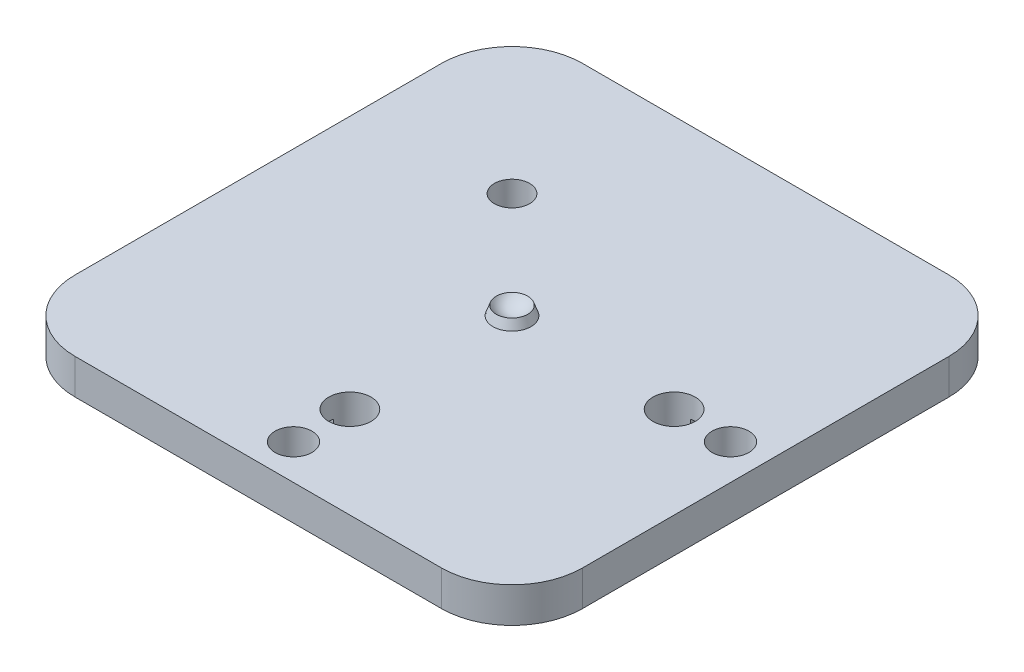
from build123d import *

# Parameters (mm, degrees)
SKETCH4_W           = 72
SKETCH4_H           = 72
SKETCH4_R           = 3
SKETCH4_R_2         = 2.5
SKETCH4_R_3         = 2.625
BOSS_EXTRUDE2_DEPTH = 5
SKETCH5_W           = 10.6
SKETCH5_H           = 1.2
SKETCH5_W_2         = 1.2
SKETCH5_H_2         = 10.6
CUT_EXTRUDE1_DEPTH  = 2
FILLET1_R           = 10


with BuildPart() as part:
    # Sketch3 → Revolve1 (revolve)
    with BuildSketch(Plane.XY, mode=Mode.PRIVATE) as revolve1_sk:
        with BuildLine():
            Line((0, 0), (2.7, 0))
            Line((2.7, 0), (2.233206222, 1.282505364))
            ThreePointArc((2.233206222, 1.282505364), (1.26348021, 0.413869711), (0, 0.1))
            Line((0, 0.1), (0, 0))
        make_face()
    revolve(revolve1_sk.sketch.rotate(Axis((0, 0.1, 0), (0, -1, 0)), 90), axis=Axis((0, 0.1, 0), (0, -1, 0)))

    # Sketch4 → Boss-Extrude2 (add)
    with BuildSketch(Plane.XZ):
        Rectangle(SKETCH4_W, SKETCH4_H)
        with Locations(Location((23, 0, 0), (0, 0, 270))):
            Circle(SKETCH4_R, mode=Mode.SUBTRACT)
        with Locations(Location((0, 23, 0), (0, 0, 270))):
            Circle(SKETCH4_R, mode=Mode.SUBTRACT)
        with Locations(Location((-15, -15, 0), (0, 0, 270))):
            Circle(SKETCH4_R_2, mode=Mode.SUBTRACT)
        with Locations(Location((0, 31, 0), (0, 0, 270))):
            Circle(SKETCH4_R_3, mode=Mode.SUBTRACT)
        with Locations(Location((31, 0, 0), (0, 0, 270))):
            Circle(SKETCH4_R_3, mode=Mode.SUBTRACT)
    extrude(amount=BOSS_EXTRUDE2_DEPTH)

    # Sketch5 → Cut-Extrude1 (cut)
    with BuildSketch(Plane.XZ.offset(5)):
        with Locations((0, 23)):
            Rectangle(SKETCH5_W, SKETCH5_H)
        with Locations((23, 0)):
            Rectangle(SKETCH5_W_2, SKETCH5_H_2)
        Polygon((-18.323401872, -10.828069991), (-10.828069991, -18.323401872), (-11.676598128, -19.171930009), (-19.171930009, -11.676598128), align=None)
    extrude(amount=-CUT_EXTRUDE1_DEPTH, mode=Mode.SUBTRACT)

    # Fillet1
    fillet1_edges = [part.edges().sort_by_distance(p)[0] for p in [
        (36, -2.5, -36),
        (36, -2.5, 36),
        (-36, -2.5, 36),
        (-36, -2.5, -36),
    ]]
    fillet(fillet1_edges, radius=FILLET1_R)


solid = part.part
